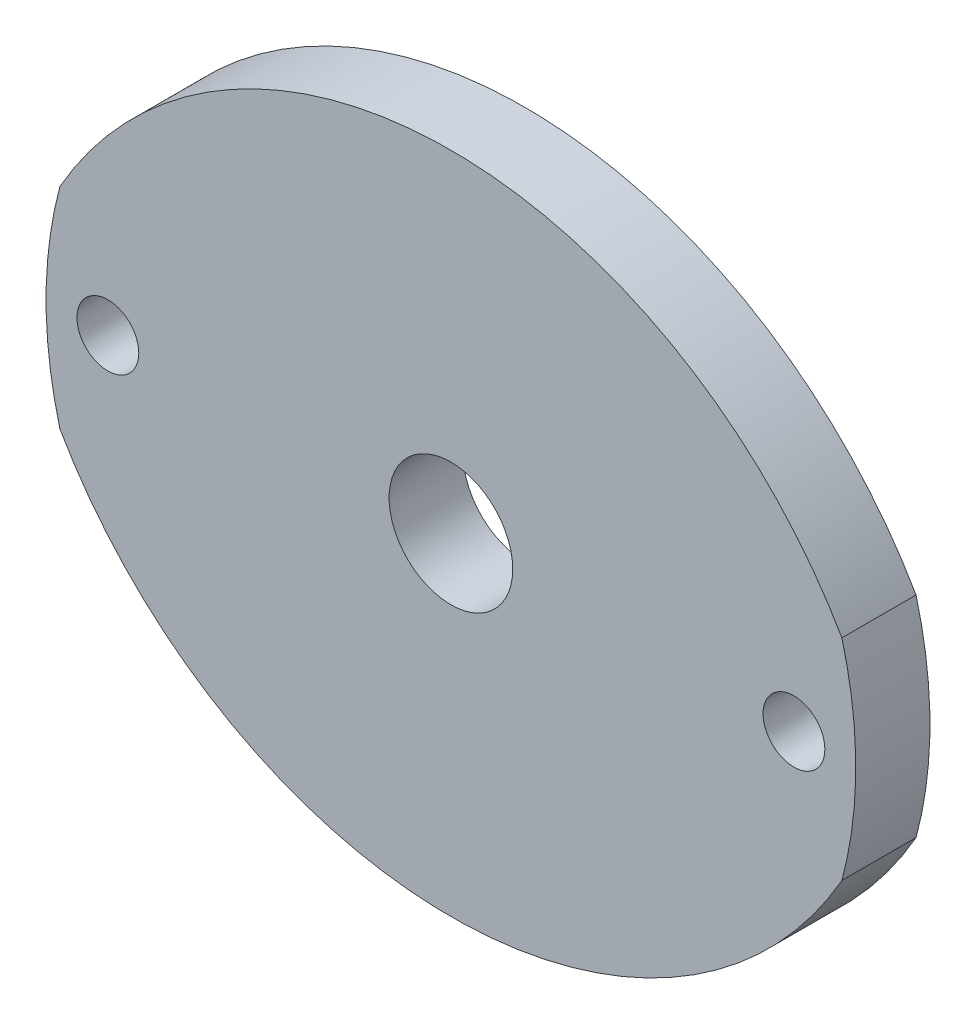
ISO-10303-21;
HEADER;
FILE_DESCRIPTION(('STEP AP214'),'2;1');
FILE_NAME('part.step','',(''),(''),'','','');
FILE_SCHEMA(('AUTOMOTIVE_DESIGN { 1 0 10303 214 1 1 1 1 }'));
ENDSEC;
DATA;
#1=APPLICATION_CONTEXT('core data for automotive mechanical design processes');
#2=APPLICATION_PROTOCOL_DEFINITION('international standard','automotive_design',2000,#1);
#3=PRODUCT_CONTEXT('',#1,'mechanical');
#4=PRODUCT('Part','Part','',(#3));
#5=PRODUCT_RELATED_PRODUCT_CATEGORY('part','',(#4));
#6=PRODUCT_DEFINITION_FORMATION('','',#4);
#7=PRODUCT_DEFINITION_CONTEXT('part definition',#1,'design');
#8=PRODUCT_DEFINITION('design','',#6,#7);
#9=PRODUCT_DEFINITION_SHAPE('','',#8);
#10=(LENGTH_UNIT() NAMED_UNIT(*) SI_UNIT(.MILLI.,.METRE.));
#11=(NAMED_UNIT(*) PLANE_ANGLE_UNIT() SI_UNIT($,.RADIAN.));
#12=(NAMED_UNIT(*) SI_UNIT($,.STERADIAN.) SOLID_ANGLE_UNIT());
#13=UNCERTAINTY_MEASURE_WITH_UNIT(LENGTH_MEASURE(1.E-05),#10,'distance_accuracy_value','');
#14=(GEOMETRIC_REPRESENTATION_CONTEXT(3) GLOBAL_UNCERTAINTY_ASSIGNED_CONTEXT((#13)) GLOBAL_UNIT_ASSIGNED_CONTEXT((#10,
#11,#12)) REPRESENTATION_CONTEXT('',''));
#15=CARTESIAN_POINT('',(0.,0.,0.));
#16=DIRECTION('',(0.,0.,1.));
#17=DIRECTION('',(1.,0.,0.));
#18=AXIS2_PLACEMENT_3D('',#15,#16,#17);
#19=CARTESIAN_POINT('',(11.2572255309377,303.477796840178,3.));
#20=DIRECTION('',(0.,0.,1.));
#21=DIRECTION('',(1.,0.,0.));
#22=AXIS2_PLACEMENT_3D('',#19,#20,#21);
#23=PLANE('',#22);
#24=CARTESIAN_POINT('',(25.1322255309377,305.873196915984,3.));
#25=DIRECTION('',(0.,0.,1.));
#26=DIRECTION('',(1.,0.,0.));
#27=AXIS2_PLACEMENT_3D('',#24,#25,#26);
#28=CIRCLE('',#27,1.25);
#29=CARTESIAN_POINT('',(26.3822255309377,305.873196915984,3.));
#30=VERTEX_POINT('',#29);
#31=EDGE_CURVE('E143',#30,#30,#28,.T.);
#32=ORIENTED_EDGE('',*,*,#31,.F.);
#33=EDGE_LOOP('',(#32));
#34=FACE_BOUND('',#33,.T.);
#35=CARTESIAN_POINT('',(11.2572255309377,301.082396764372,3.));
#36=DIRECTION('',(0.,0.,1.));
#37=DIRECTION('',(1.,0.,0.));
#38=AXIS2_PLACEMENT_3D('',#35,#36,#37);
#39=CIRCLE('',#38,18.2158001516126);
#40=CARTESIAN_POINT('',(27.0710509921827,310.123320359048,3.));
#41=VERTEX_POINT('',#40);
#42=CARTESIAN_POINT('',(-4.55659993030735,310.123320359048,3.));
#43=VERTEX_POINT('',#42);
#44=EDGE_CURVE('E99',#41,#43,#39,.T.);
#45=ORIENTED_EDGE('',*,*,#44,.T.);
#46=CARTESIAN_POINT('',(11.2572255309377,305.873196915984,3.));
#47=DIRECTION('',(0.,0.,1.));
#48=DIRECTION('',(1.,0.,0.));
#49=AXIS2_PLACEMENT_3D('',#46,#47,#48);
#50=CIRCLE('',#49,16.375);
#51=CARTESIAN_POINT('',(-4.55659993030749,301.623073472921,3.));
#52=VERTEX_POINT('',#51);
#53=EDGE_CURVE('E93',#43,#52,#50,.T.);
#54=ORIENTED_EDGE('',*,*,#53,.T.);
#55=CARTESIAN_POINT('',(11.2572255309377,310.663997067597,3.));
#56=DIRECTION('',(0.,0.,1.));
#57=DIRECTION('',(1.,0.,0.));
#58=AXIS2_PLACEMENT_3D('',#55,#56,#57);
#59=CIRCLE('',#58,18.2158001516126);
#60=CARTESIAN_POINT('',(27.071050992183,301.623073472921,3.));
#61=VERTEX_POINT('',#60);
#62=EDGE_CURVE('E97',#52,#61,#59,.T.);
#63=ORIENTED_EDGE('',*,*,#62,.T.);
#64=CARTESIAN_POINT('',(11.2572255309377,305.873196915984,3.));
#65=DIRECTION('',(0.,0.,1.));
#66=DIRECTION('',(1.,0.,0.));
#67=AXIS2_PLACEMENT_3D('',#64,#65,#66);
#68=CIRCLE('',#67,16.375);
#69=EDGE_CURVE('E58',#61,#41,#68,.T.);
#70=ORIENTED_EDGE('',*,*,#69,.T.);
#71=EDGE_LOOP('',(#45,#54,#63,#70));
#72=FACE_BOUND('',#71,.T.);
#73=CARTESIAN_POINT('',(11.2572255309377,305.873196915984,3.));
#74=DIRECTION('',(0.,0.,1.));
#75=DIRECTION('',(1.,0.,0.));
#76=AXIS2_PLACEMENT_3D('',#73,#74,#75);
#77=CIRCLE('',#76,2.5);
#78=CARTESIAN_POINT('',(13.7572255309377,305.873196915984,3.));
#79=VERTEX_POINT('',#78);
#80=EDGE_CURVE('E120',#79,#79,#77,.T.);
#81=ORIENTED_EDGE('',*,*,#80,.F.);
#82=EDGE_LOOP('',(#81));
#83=FACE_BOUND('',#82,.T.);
#84=CARTESIAN_POINT('',(-2.61777446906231,305.873196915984,3.));
#85=DIRECTION('',(0.,0.,1.));
#86=DIRECTION('',(1.,0.,0.));
#87=AXIS2_PLACEMENT_3D('',#84,#85,#86);
#88=CIRCLE('',#87,1.25);
#89=CARTESIAN_POINT('',(-1.36777446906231,305.873196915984,3.));
#90=VERTEX_POINT('',#89);
#91=EDGE_CURVE('E150',#90,#90,#88,.T.);
#92=ORIENTED_EDGE('',*,*,#91,.F.);
#93=EDGE_LOOP('',(#92));
#94=FACE_BOUND('',#93,.T.);
#95=ADVANCED_FACE('F38',(#34,#72,#83,#94),#23,.T.);
#96=CARTESIAN_POINT('',(11.2572255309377,303.477796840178,0.));
#97=DIRECTION('',(0.,0.,1.));
#98=DIRECTION('',(1.,0.,0.));
#99=AXIS2_PLACEMENT_3D('',#96,#97,#98);
#100=PLANE('',#99);
#101=CARTESIAN_POINT('',(11.2572255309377,301.082396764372,0.));
#102=DIRECTION('',(0.,0.,1.));
#103=DIRECTION('',(1.,0.,0.));
#104=AXIS2_PLACEMENT_3D('',#101,#102,#103);
#105=CIRCLE('',#104,18.2158001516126);
#106=CARTESIAN_POINT('',(27.0710509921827,310.123320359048,0.));
#107=VERTEX_POINT('',#106);
#108=CARTESIAN_POINT('',(-4.55659993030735,310.123320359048,0.));
#109=VERTEX_POINT('',#108);
#110=EDGE_CURVE('E116',#107,#109,#105,.T.);
#111=ORIENTED_EDGE('',*,*,#110,.F.);
#112=CARTESIAN_POINT('',(11.2572255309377,305.873196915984,0.));
#113=DIRECTION('',(0.,0.,1.));
#114=DIRECTION('',(1.,0.,0.));
#115=AXIS2_PLACEMENT_3D('',#112,#113,#114);
#116=CIRCLE('',#115,16.375);
#117=CARTESIAN_POINT('',(27.071050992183,301.623073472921,0.));
#118=VERTEX_POINT('',#117);
#119=EDGE_CURVE('E85',#118,#107,#116,.T.);
#120=ORIENTED_EDGE('',*,*,#119,.F.);
#121=CARTESIAN_POINT('',(11.2572255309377,310.663997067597,0.));
#122=DIRECTION('',(0.,0.,1.));
#123=DIRECTION('',(1.,0.,0.));
#124=AXIS2_PLACEMENT_3D('',#121,#122,#123);
#125=CIRCLE('',#124,18.2158001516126);
#126=CARTESIAN_POINT('',(-4.55659993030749,301.623073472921,0.));
#127=VERTEX_POINT('',#126);
#128=EDGE_CURVE('E79',#127,#118,#125,.T.);
#129=ORIENTED_EDGE('',*,*,#128,.F.);
#130=CARTESIAN_POINT('',(11.2572255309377,305.873196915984,0.));
#131=DIRECTION('',(0.,0.,1.));
#132=DIRECTION('',(1.,0.,0.));
#133=AXIS2_PLACEMENT_3D('',#130,#131,#132);
#134=CIRCLE('',#133,16.375);
#135=EDGE_CURVE('E104',#109,#127,#134,.T.);
#136=ORIENTED_EDGE('',*,*,#135,.F.);
#137=EDGE_LOOP('',(#111,#120,#129,#136));
#138=FACE_BOUND('',#137,.T.);
#139=CARTESIAN_POINT('',(11.2572255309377,305.873196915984,0.));
#140=DIRECTION('',(0.,0.,1.));
#141=DIRECTION('',(1.,0.,0.));
#142=AXIS2_PLACEMENT_3D('',#139,#140,#141);
#143=CIRCLE('',#142,2.5);
#144=CARTESIAN_POINT('',(13.7572255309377,305.873196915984,0.));
#145=VERTEX_POINT('',#144);
#146=EDGE_CURVE('E139',#145,#145,#143,.T.);
#147=ORIENTED_EDGE('',*,*,#146,.T.);
#148=EDGE_LOOP('',(#147));
#149=FACE_BOUND('',#148,.T.);
#150=CARTESIAN_POINT('',(25.1322255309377,305.873196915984,0.));
#151=DIRECTION('',(0.,0.,1.));
#152=DIRECTION('',(1.,0.,0.));
#153=AXIS2_PLACEMENT_3D('',#150,#151,#152);
#154=CIRCLE('',#153,1.25);
#155=CARTESIAN_POINT('',(26.3822255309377,305.873196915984,0.));
#156=VERTEX_POINT('',#155);
#157=EDGE_CURVE('E147',#156,#156,#154,.T.);
#158=ORIENTED_EDGE('',*,*,#157,.T.);
#159=EDGE_LOOP('',(#158));
#160=FACE_BOUND('',#159,.T.);
#161=CARTESIAN_POINT('',(-2.61777446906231,305.873196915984,0.));
#162=DIRECTION('',(0.,0.,1.));
#163=DIRECTION('',(1.,0.,0.));
#164=AXIS2_PLACEMENT_3D('',#161,#162,#163);
#165=CIRCLE('',#164,1.25);
#166=CARTESIAN_POINT('',(-1.36777446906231,305.873196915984,0.));
#167=VERTEX_POINT('',#166);
#168=EDGE_CURVE('E154',#167,#167,#165,.T.);
#169=ORIENTED_EDGE('',*,*,#168,.T.);
#170=EDGE_LOOP('',(#169));
#171=FACE_BOUND('',#170,.T.);
#172=ADVANCED_FACE('F134',(#138,#149,#160,#171),#100,.F.);
#173=CARTESIAN_POINT('',(11.2572255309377,301.082396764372,3.));
#174=DIRECTION('',(0.,0.,-1.));
#175=DIRECTION('',(-1.,0.,0.));
#176=AXIS2_PLACEMENT_3D('',#173,#174,#175);
#177=CYLINDRICAL_SURFACE('',#176,18.2158001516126);
#178=ORIENTED_EDGE('',*,*,#110,.T.);
#179=DIRECTION('',(0.,0.,-1.));
#180=VECTOR('',#179,1.);
#181=CARTESIAN_POINT('',(-4.55659993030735,310.123320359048,3.));
#182=LINE('',#181,#180);
#183=EDGE_CURVE('E11',#43,#109,#182,.T.);
#184=ORIENTED_EDGE('',*,*,#183,.F.);
#185=ORIENTED_EDGE('',*,*,#44,.F.);
#186=DIRECTION('',(0.,0.,-1.));
#187=VECTOR('',#186,1.);
#188=CARTESIAN_POINT('',(27.0710509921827,310.123320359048,3.));
#189=LINE('',#188,#187);
#190=EDGE_CURVE('E112',#41,#107,#189,.T.);
#191=ORIENTED_EDGE('',*,*,#190,.T.);
#192=EDGE_LOOP('',(#178,#184,#185,#191));
#193=FACE_BOUND('',#192,.T.);
#194=ADVANCED_FACE('F40',(#193),#177,.T.);
#195=CARTESIAN_POINT('',(11.2572255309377,305.873196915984,3.));
#196=DIRECTION('',(0.,0.,-1.));
#197=DIRECTION('',(-1.,0.,0.));
#198=AXIS2_PLACEMENT_3D('',#195,#196,#197);
#199=CYLINDRICAL_SURFACE('',#198,16.375);
#200=ORIENTED_EDGE('',*,*,#135,.T.);
#201=DIRECTION('',(0.,0.,-1.));
#202=VECTOR('',#201,1.);
#203=CARTESIAN_POINT('',(-4.55659993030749,301.623073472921,3.));
#204=LINE('',#203,#202);
#205=EDGE_CURVE('E48',#52,#127,#204,.T.);
#206=ORIENTED_EDGE('',*,*,#205,.F.);
#207=ORIENTED_EDGE('',*,*,#53,.F.);
#208=ORIENTED_EDGE('',*,*,#183,.T.);
#209=EDGE_LOOP('',(#200,#206,#207,#208));
#210=FACE_BOUND('',#209,.T.);
#211=ADVANCED_FACE('F103',(#210),#199,.T.);
#212=CARTESIAN_POINT('',(11.2572255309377,310.663997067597,3.));
#213=DIRECTION('',(0.,0.,-1.));
#214=DIRECTION('',(-1.,0.,0.));
#215=AXIS2_PLACEMENT_3D('',#212,#213,#214);
#216=CYLINDRICAL_SURFACE('',#215,18.2158001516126);
#217=ORIENTED_EDGE('',*,*,#128,.T.);
#218=DIRECTION('',(0.,0.,-1.));
#219=VECTOR('',#218,1.);
#220=CARTESIAN_POINT('',(27.071050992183,301.623073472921,3.));
#221=LINE('',#220,#219);
#222=EDGE_CURVE('E106',#61,#118,#221,.T.);
#223=ORIENTED_EDGE('',*,*,#222,.F.);
#224=ORIENTED_EDGE('',*,*,#62,.F.);
#225=ORIENTED_EDGE('',*,*,#205,.T.);
#226=EDGE_LOOP('',(#217,#223,#224,#225));
#227=FACE_BOUND('',#226,.T.);
#228=ADVANCED_FACE('F107',(#227),#216,.T.);
#229=CARTESIAN_POINT('',(11.2572255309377,305.873196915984,3.));
#230=DIRECTION('',(0.,0.,-1.));
#231=DIRECTION('',(-1.,0.,0.));
#232=AXIS2_PLACEMENT_3D('',#229,#230,#231);
#233=CYLINDRICAL_SURFACE('',#232,16.375);
#234=ORIENTED_EDGE('',*,*,#119,.T.);
#235=ORIENTED_EDGE('',*,*,#190,.F.);
#236=ORIENTED_EDGE('',*,*,#69,.F.);
#237=ORIENTED_EDGE('',*,*,#222,.T.);
#238=EDGE_LOOP('',(#234,#235,#236,#237));
#239=FACE_BOUND('',#238,.T.);
#240=ADVANCED_FACE('F131',(#239),#233,.T.);
#241=CARTESIAN_POINT('',(11.2572255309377,305.873196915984,3.));
#242=DIRECTION('',(0.,0.,-1.));
#243=DIRECTION('',(-1.,0.,0.));
#244=AXIS2_PLACEMENT_3D('',#241,#242,#243);
#245=CYLINDRICAL_SURFACE('',#244,2.5);
#246=ORIENTED_EDGE('',*,*,#80,.T.);
#247=EDGE_LOOP('',(#246));
#248=FACE_BOUND('',#247,.T.);
#249=ORIENTED_EDGE('',*,*,#146,.F.);
#250=EDGE_LOOP('',(#249));
#251=FACE_BOUND('',#250,.T.);
#252=ADVANCED_FACE('F173',(#248,#251),#245,.F.);
#253=CARTESIAN_POINT('',(25.1322255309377,305.873196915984,3.));
#254=DIRECTION('',(0.,0.,-1.));
#255=DIRECTION('',(-1.,0.,0.));
#256=AXIS2_PLACEMENT_3D('',#253,#254,#255);
#257=CYLINDRICAL_SURFACE('',#256,1.25);
#258=ORIENTED_EDGE('',*,*,#31,.T.);
#259=EDGE_LOOP('',(#258));
#260=FACE_BOUND('',#259,.T.);
#261=ORIENTED_EDGE('',*,*,#157,.F.);
#262=EDGE_LOOP('',(#261));
#263=FACE_BOUND('',#262,.T.);
#264=ADVANCED_FACE('F199',(#260,#263),#257,.F.);
#265=CARTESIAN_POINT('',(-2.61777446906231,305.873196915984,3.));
#266=DIRECTION('',(0.,0.,-1.));
#267=DIRECTION('',(-1.,0.,0.));
#268=AXIS2_PLACEMENT_3D('',#265,#266,#267);
#269=CYLINDRICAL_SURFACE('',#268,1.25);
#270=ORIENTED_EDGE('',*,*,#91,.T.);
#271=EDGE_LOOP('',(#270));
#272=FACE_BOUND('',#271,.T.);
#273=ORIENTED_EDGE('',*,*,#168,.F.);
#274=EDGE_LOOP('',(#273));
#275=FACE_BOUND('',#274,.T.);
#276=ADVANCED_FACE('F161',(#272,#275),#269,.F.);
#277=CLOSED_SHELL('',(#95,#172,#194,#211,#228,#240,#252,#264,#276));
#278=MANIFOLD_SOLID_BREP('B2',#277);
#279=ADVANCED_BREP_SHAPE_REPRESENTATION('',(#18,#278),#14);
#280=SHAPE_DEFINITION_REPRESENTATION(#9,#279);
ENDSEC;
END-ISO-10303-21;
